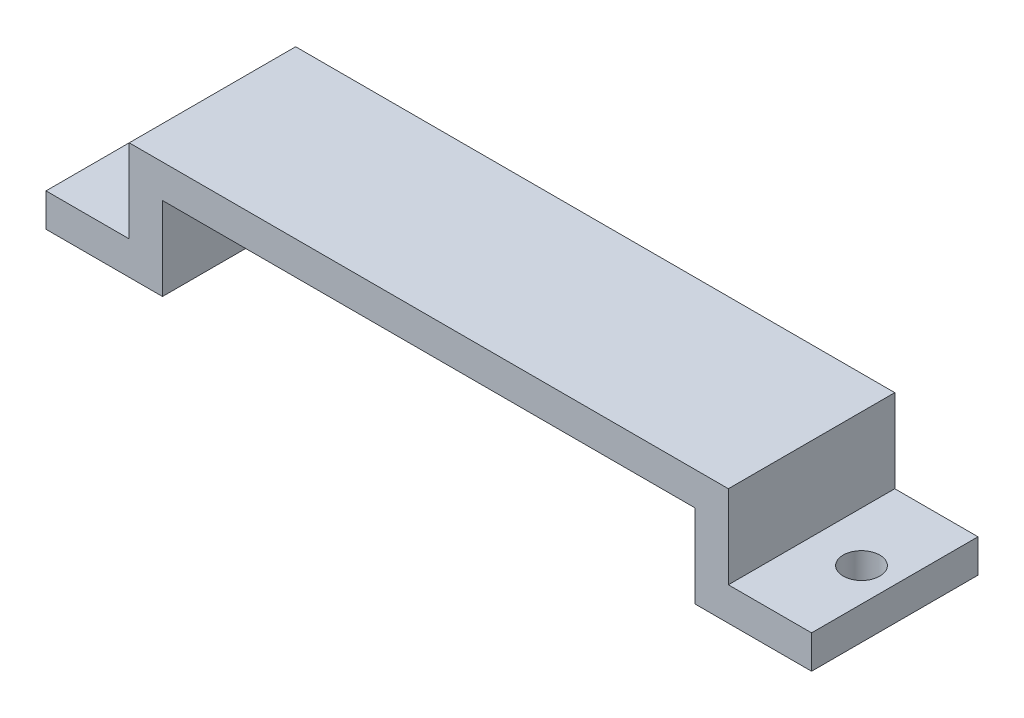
from build123d import *

# Parameters (mm, degrees)
AUFSATZ_LINEAR_AUSTRAGEN1_DEPTH = 5
SKIZZE3_R                       = 1.1
SCHNITT_LINEAR_AUSTRAGEN1_DEPTH = 25.062418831


with BuildPart() as part:
    # Skizze2 → Aufsatz-Linear austragen1 (new, symmetric)
    with BuildSketch(Plane.XY):
        Polygon((-16, 0), (16, 0), (16, -5), (23, -5), (23, -3), (18, -3), (18, 2), (-18, 2), (-18, -3), (-23, -3), (-23, -5), (-16, -5), align=None)
    extrude(amount=AUFSATZ_LINEAR_AUSTRAGEN1_DEPTH, both=True)

    # Skizze3 → Schnitt-Linear austragen1 (cut, through all)
    with BuildSketch(Plane(origin=(0, -3, 0), x_dir=(1, 0, 0), z_dir=(0, 1, 0))):
        with Locations(Location((21, 0, 0), (0, 0, 270))):
            Circle(SKIZZE3_R)
        with Locations(Location((-21, 0, 0), (0, 0, 90))):
            Circle(SKIZZE3_R)
    extrude(amount=-SCHNITT_LINEAR_AUSTRAGEN1_DEPTH, mode=Mode.SUBTRACT)


solid = part.part
